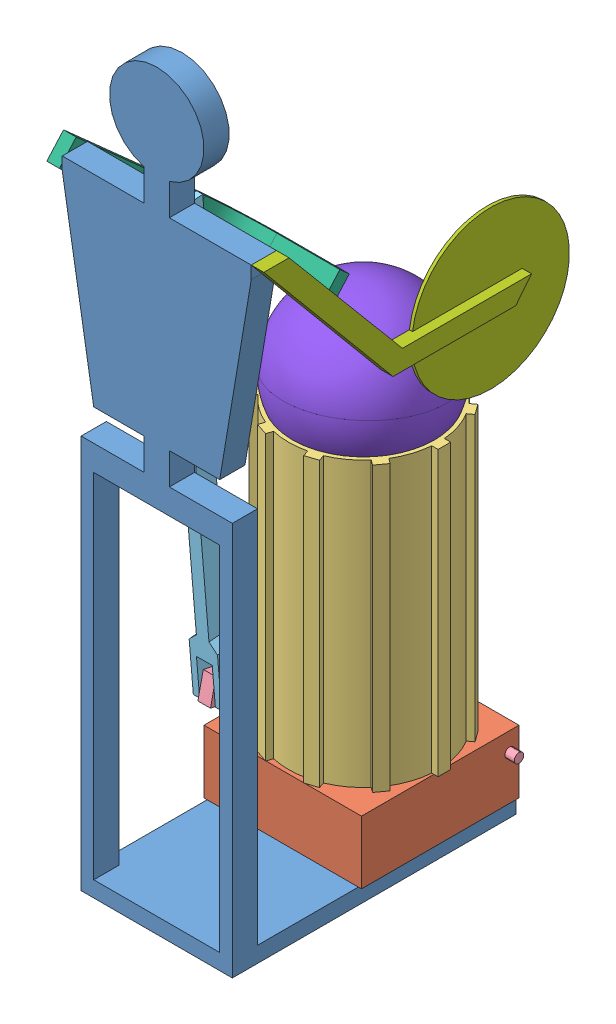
SolidWorks assembly Assemblage1.SLDASM, configuration Défaut (file format 15000). Lengths in mm.
Overall size (70.5 238.46 108.3).
9 component instances, 8 part files, 17 mates.
Components (placement in the parent):
- main-1: main.SLDPRT [Défaut] at (-227.557 5 232.3304) x (1 0 0) z (0 -1 0) size (60 90 238.46)
- support-1: support.SLDPRT [Défaut] at (-251.557 25 175.3304) x (1 0 0) z (0 0 -1) size (50 20 50)
- trash-1: trash.SLDPRT [Défaut] at (-250.8914 115 175.3579) x (0 -1 0) z (0 0 1) size (90 51.33 50.06)
- levier-1: levier.SLDPRT [Défaut] at (-281.557 21.133 163.1003) x (0 0.213303 0.976986) z (-1 0 0) size (60 8 62)
- lift 3dprint-1: lift 3dprint.SLDPRT [Défaut] at (-279.057 168.1576 204.2124) x (1 0 0) z (0 0.996574 0.082703) size (9 6 145)
- moving arm-1: moving arm.SLDPRT [Défaut] at (-285.557 196.0155 241.2326) x (1 0 0) z (0 0.745767 -0.666206) size (37 72 8)
- right arm-2: right arm.SLDPRT [Défaut] at (-221.557 199 240.3304) x (0 0 -1) z (0 -1 0) size (100 4 71.14)
- half trash-1: half trash.SLDPRT [Défaut] at (-250.8914 123.3516 175.3579) x (-0.862693 -0.097781 -0.496186) z (0.057382 -0.99372 0.09606) size (48 48 24)
- half trash-2: half trash.SLDPRT [Défaut] at (-250.8914 123.3516 175.3579) x (-0.940881 -0.086002 -0.327638) z (-0.057382 0.99372 -0.09606) size (48 48 24)
Mates (geometry in assembly coordinates):
- Coïncidente3: coincident anti-aligned: plane of main-1 through (-227.557 5 150.3304) normal (0 1 0); plane of support-1 through (-251.557 5 175.3304) normal (0 -1 0)
- Coïncidente4: coincident aligned: plane of main-1 through (-227.557 5 150.3304) normal (0 0 -1); plane of support-1 through (-276.557 21 150.3304) normal (0 0 -1)
- Distance1: distance = 1 mm aligned: plane of main-1 through (-227.557 5 240.3304) normal (1 0 0); plane of support-1 through (-226.557 21 200.3304) normal (1 0 0)
- Coïncidente6: coincident anti-aligned: plane of support-1 through (-251.557 25 175.3304) normal (0 1 0); plane of trash-1 through (-250.8914 25 175.3579) normal (0 -1 0)
- Coïncidente7: coincident aligned: plane of support-1 through (-276.557 21 200.3304) normal (-1 0 0); plane of trash-1 through (-276.557 25 173.3579) normal (-1 0 0)
- Coïncidente8: coincident: plane of support-1 through (-276.557 21 150.3304) normal (0 0 -1); line of trash-1 through (-244.8623 25 150.3304) axis (0 1 0)
- Coaxiale1: concentric aligned: cylinder of support-1 through (-226.557 19 153.3304) axis (-1 0 0) radius 1.5; cylinder of levier-1 through (-223.557 19 153.3304) axis (-1 0 0) radius 1.5
- Distance2: distance = 3 mm aligned: plane of levier-1 through (-223.557 19 153.3304) normal (1 0 0); plane of support-1 through (-226.557 21 200.3304) normal (1 0 0)
- Coaxiale2: concentric anti-aligned: cylinder of levier-1 through (-285.557 26.8922 189.4789) axis (1 0 0) radius 1.5; cylinder of lift 3dprint-1 through (-279.057 26.8922 189.4789) axis (-1 0 0) radius 1.5
- Distance3: distance = 0.5 mm anti-aligned: plane of lift 3dprint-1 through (-286.057 36.1095 187.2335) normal (1 0 0); plane of levier-1 through (-285.557 21.133 163.1003) normal (-1 0 0)
- Coaxiale3: concentric aligned: cylinder of main-1 through (-221.557 197 236.3304) axis (-1 0 0) radius 1.5; cylinder of moving arm-1 through (-248.557 197 236.3304) axis (-1 0 0) radius 1.5
- Coïncidente11: coincident anti-aligned: plane of main-1 through (-281.557 195 240.3304) normal (-1 0 0); plane of moving arm-1 through (-281.557 165.3403 194.8857) normal (1 0 0)
- Coaxiale4: concentric aligned: cylinder of lift 3dprint-1 through (-279.057 165.416 200.9746) axis (-1 0 0) radius 1.5; cylinder of moving arm-1 through (-248.557 165.416 200.9746) axis (-1 0 0) radius 1.5
- Coïncidente15: coincident anti-aligned: plane of main-1 through (-221.557 199 240.3304) normal (1 0 0); plane of right arm-2 through (-221.557 199 240.3304) normal (-1 0 0)
- Coïncidente16: coincident aligned: plane of main-1 through (-247.557 199 240.3304) normal (0 1 0); plane of right arm-2 through (-217.557 199 240.3304) normal (0 1 0)
- Coïncidente17: coincident aligned: line of main-1 through (-221.557 199 240.3304) axis (-1 0 0); line of right arm-2 through (-217.557 199 240.3304) axis (-1 0 0)
- Coïncidente18: coincident anti-aligned: circle of half trash-1; circle of half trash-2
